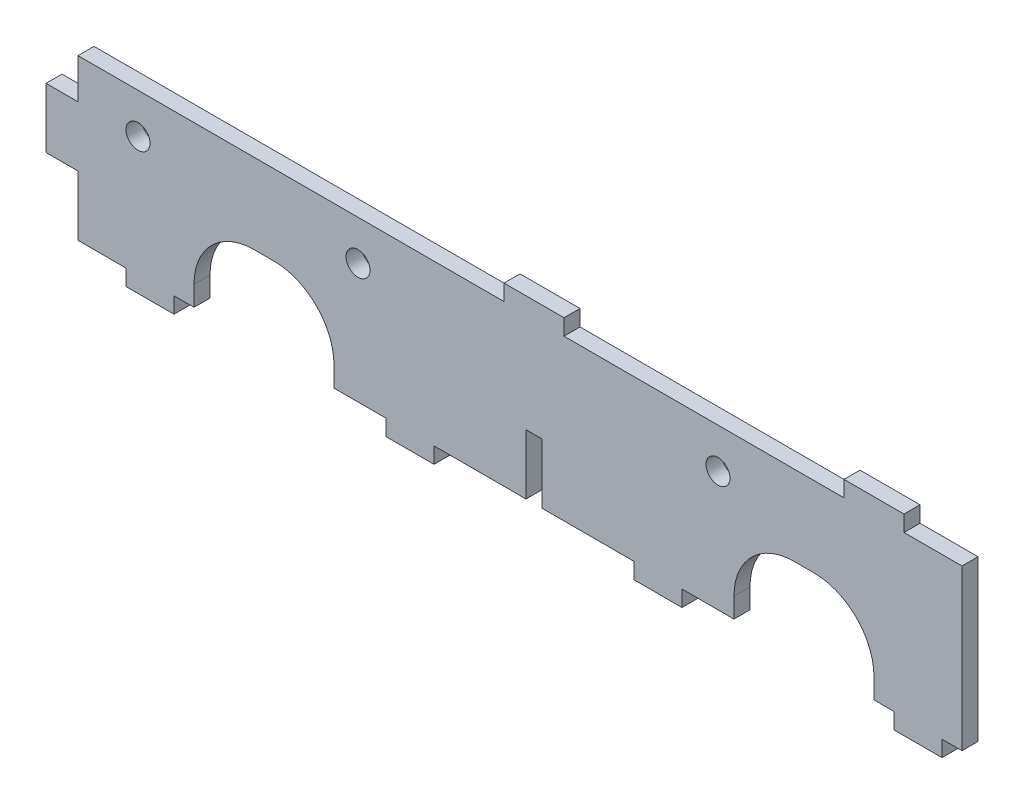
from build123d import *

# Parameters (mm, degrees)
SKETCH1_R           = 3
BOSS_EXTRUDE1_DEPTH = 2


with BuildPart() as part:
    # Sketch1 → Boss-Extrude1 (new, symmetric)
    with BuildSketch(Plane.XY):
        with BuildLine():
            Line((102, 0), (107, 0))
            Line((107, 0), (107, 40))
            Line((107, 40), (92.5, 40))
            Line((92.5, 40), (92.5, 44))
            Line((92.5, 44), (77.5, 44))
            Line((77.5, 44), (77.5, 40))
            Line((77.5, 40), (7.5, 40))
            Line((7.5, 40), (7.5, 44))
            Line((7.5, 44), (-7.5, 44))
            Line((-7.5, 44), (-7.5, 40))
            Line((-7.5, 40), (-114, 40))
            Line((-114, 40), (-114, 30))
            Line((-114, 30), (-122, 30))
            Line((-122, 30), (-122, 15))
            Line((-122, 15), (-114, 15))
            Line((-114, 15), (-114, 0))
            Line((-114, 0), (-102, 0))
            Line((-102, 0), (-102, -4))
            Line((-102, -4), (-90, -4))
            Line((-90, -4), (-90, 0))
            Line((-90, 0), (-85, 0))
            Line((-85, 0), (-85, 5))
            ThreePointArc((-85, 5), (-80.606601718, 15.606601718), (-70, 20))
            Line((-70, 20), (-65, 20))
            ThreePointArc((-65, 20), (-54.393398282, 15.606601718), (-50, 5))
            Line((-50, 5), (-50, 0))
            Line((-50, 0), (-37, 0))
            Line((-37, 0), (-37, -4))
            Line((-37, -4), (-25, -4))
            Line((-25, -4), (-25, 0))
            Line((-25, 0), (-2, 0))
            Line((-2, 0), (-2, 15))
            Line((-2, 15), (2, 15))
            Line((2, 15), (2, 0))
            Line((2, 0), (25, 0))
            Line((25, 0), (25, -4))
            Line((25, -4), (37, -4))
            Line((37, -4), (37, 0))
            Line((37, 0), (50, 0))
            Line((50, 0), (50, 5))
            ThreePointArc((50, 5), (54.393398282, 15.606601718), (65, 20))
            Line((65, 20), (70, 20))
            ThreePointArc((70, 20), (80.606601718, 15.606601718), (85, 5))
            Line((85, 5), (85, 0))
            Line((85, 0), (90, 0))
            Line((90, 0), (90, -4))
            Line((90, -4), (102, -4))
            Line((102, -4), (102, 0))
        make_face()
        with Locations((-44, 30)):
            Circle(SKETCH1_R, mode=Mode.SUBTRACT)
        with Locations((-99, 30)):
            Circle(SKETCH1_R, mode=Mode.SUBTRACT)
        with Locations((46, 30)):
            Circle(SKETCH1_R, mode=Mode.SUBTRACT)
    extrude(amount=BOSS_EXTRUDE1_DEPTH, both=True)


solid = part.part
